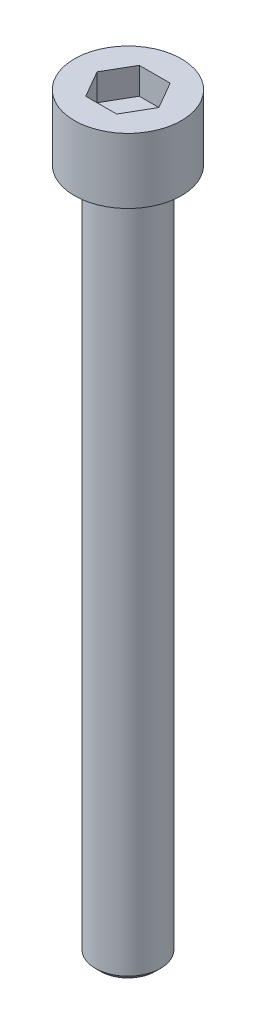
from build123d import *

# Parameters (mm, degrees)
CUT_EXTRUDE1_DEPTH = 1.984375


with BuildPart() as part:
    # Sketch1 → Base-Revolve (revolve)
    with BuildSketch(Plane.XY, mode=Mode.PRIVATE) as base_revolve_sk:
        Polygon((0, 4.826), (3.96875, 4.826), (3.96875, 0), (2.413, 0), (2.413, -50.403125), (2.016125, -50.8), (0, -50.8), align=None)
    revolve(base_revolve_sk.sketch.rotate(Axis((0, 17.272, 0), (0, -1, 0)), 90), axis=Axis((0, 17.272, 0), (0, -1, 0)))

    # Sketch2 → Cut-Extrude1 (cut)
    with BuildSketch(Plane(origin=(0, 4.826, 0), x_dir=(-1, 0, 0), z_dir=(0, 1, 0))):
        Polygon((-2.291358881, 0), (-1.14567944, -1.984375), (1.14567944, -1.984375), (2.291358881, 0), (1.14567944, 1.984375), (-1.14567944, 1.984375), align=None)
    extrude(amount=-CUT_EXTRUDE1_DEPTH, mode=Mode.SUBTRACT)


solid = part.part
